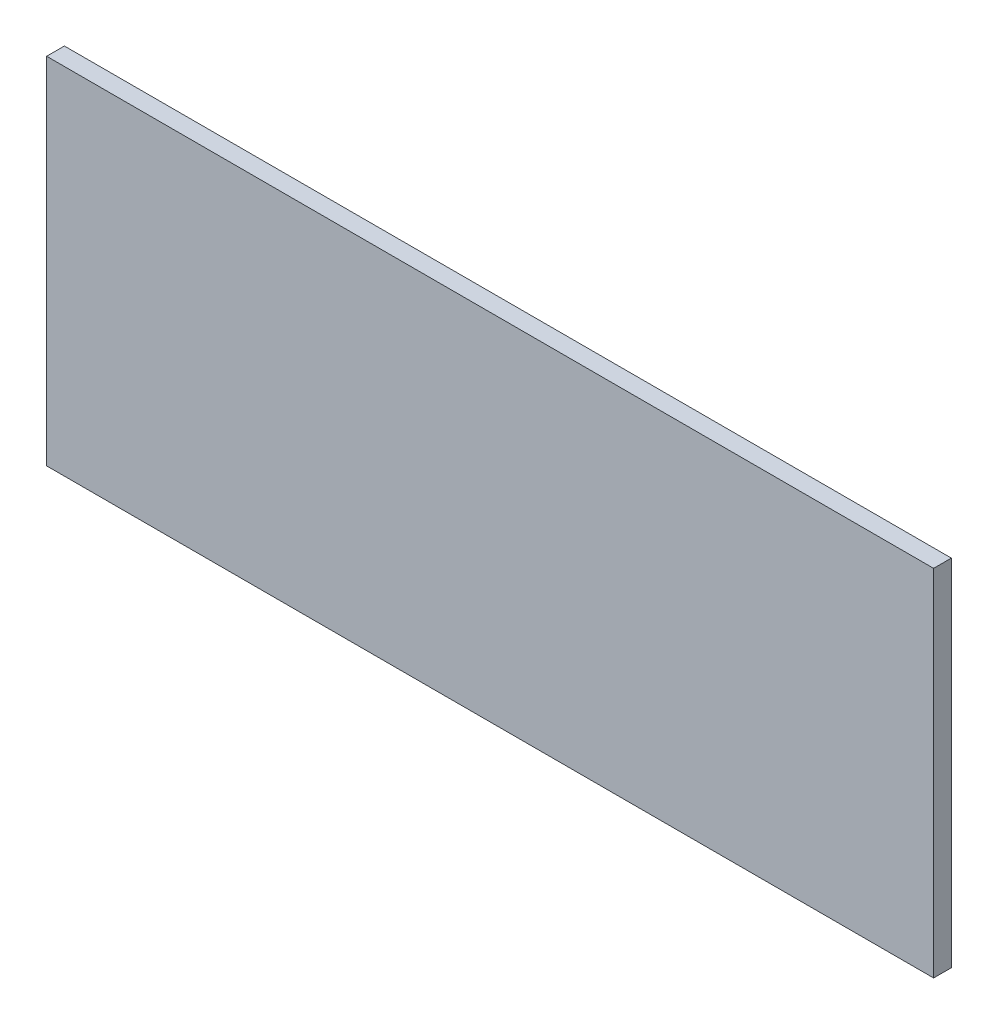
from build123d import *

# Parameters (mm, degrees)
ESQUISSE1_W      = 200
ESQUISSE1_H      = 80
EXTRUSION1_DEPTH = 4


with BuildPart() as part:
    # Esquisse1 → Extrusion1 (new body)
    with BuildSketch(Plane.XY):
        with Locations((100, 40)):
            Rectangle(ESQUISSE1_W, ESQUISSE1_H)
    extrude(amount=EXTRUSION1_DEPTH)


solid = part.part
